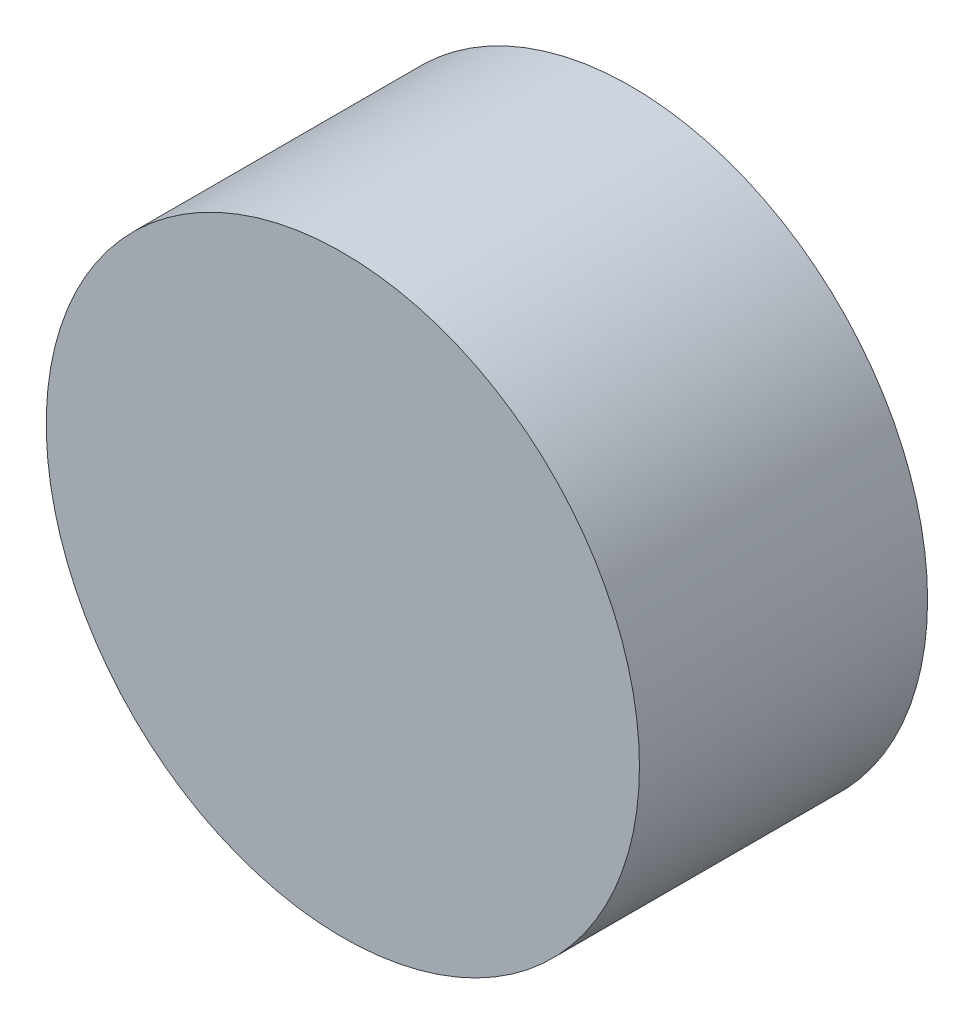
ISO-10303-21;
HEADER;
FILE_DESCRIPTION(('STEP AP214'),'2;1');
FILE_NAME('part.step','',(''),(''),'','','');
FILE_SCHEMA(('AUTOMOTIVE_DESIGN { 1 0 10303 214 1 1 1 1 }'));
ENDSEC;
DATA;
#1=APPLICATION_CONTEXT('core data for automotive mechanical design processes');
#2=APPLICATION_PROTOCOL_DEFINITION('international standard','automotive_design',2000,#1);
#3=PRODUCT_CONTEXT('',#1,'mechanical');
#4=PRODUCT('Part','Part','',(#3));
#5=PRODUCT_RELATED_PRODUCT_CATEGORY('part','',(#4));
#6=PRODUCT_DEFINITION_FORMATION('','',#4);
#7=PRODUCT_DEFINITION_CONTEXT('part definition',#1,'design');
#8=PRODUCT_DEFINITION('design','',#6,#7);
#9=PRODUCT_DEFINITION_SHAPE('','',#8);
#10=(LENGTH_UNIT() NAMED_UNIT(*) SI_UNIT(.MILLI.,.METRE.));
#11=(NAMED_UNIT(*) PLANE_ANGLE_UNIT() SI_UNIT($,.RADIAN.));
#12=(NAMED_UNIT(*) SI_UNIT($,.STERADIAN.) SOLID_ANGLE_UNIT());
#13=UNCERTAINTY_MEASURE_WITH_UNIT(LENGTH_MEASURE(1.E-05),#10,'distance_accuracy_value','');
#14=(GEOMETRIC_REPRESENTATION_CONTEXT(3) GLOBAL_UNCERTAINTY_ASSIGNED_CONTEXT((#13)) GLOBAL_UNIT_ASSIGNED_CONTEXT((#10,
#11,#12)) REPRESENTATION_CONTEXT('',''));
#15=CARTESIAN_POINT('',(0.,0.,0.));
#16=DIRECTION('',(0.,0.,1.));
#17=DIRECTION('',(1.,0.,0.));
#18=AXIS2_PLACEMENT_3D('',#15,#16,#17);
#19=CARTESIAN_POINT('',(0.,0.,10.795));
#20=DIRECTION('',(0.,0.,-1.));
#21=DIRECTION('',(-1.,0.,0.));
#22=AXIS2_PLACEMENT_3D('',#19,#20,#21);
#23=CYLINDRICAL_SURFACE('',#22,22.225);
#24=CARTESIAN_POINT('',(0.,0.,10.795));
#25=DIRECTION('',(0.,0.,1.));
#26=DIRECTION('',(1.,0.,0.));
#27=AXIS2_PLACEMENT_3D('',#24,#25,#26);
#28=CIRCLE('',#27,22.225);
#29=CARTESIAN_POINT('',(22.225,0.,10.795));
#30=VERTEX_POINT('',#29);
#31=EDGE_CURVE('E10',#30,#30,#28,.T.);
#32=ORIENTED_EDGE('',*,*,#31,.F.);
#33=EDGE_LOOP('',(#32));
#34=FACE_BOUND('',#33,.T.);
#35=CARTESIAN_POINT('',(0.,0.,-10.795));
#36=DIRECTION('',(0.,0.,1.));
#37=DIRECTION('',(1.,0.,0.));
#38=AXIS2_PLACEMENT_3D('',#35,#36,#37);
#39=CIRCLE('',#38,22.225);
#40=CARTESIAN_POINT('',(22.225,0.,-10.795));
#41=VERTEX_POINT('',#40);
#42=EDGE_CURVE('E42',#41,#41,#39,.T.);
#43=ORIENTED_EDGE('',*,*,#42,.T.);
#44=EDGE_LOOP('',(#43));
#45=FACE_BOUND('',#44,.T.);
#46=ADVANCED_FACE('F39',(#34,#45),#23,.T.);
#47=CARTESIAN_POINT('',(0.,0.,10.795));
#48=DIRECTION('',(0.,0.,1.));
#49=DIRECTION('',(1.,0.,0.));
#50=AXIS2_PLACEMENT_3D('',#47,#48,#49);
#51=PLANE('',#50);
#52=ORIENTED_EDGE('',*,*,#31,.T.);
#53=EDGE_LOOP('',(#52));
#54=FACE_BOUND('',#53,.T.);
#55=ADVANCED_FACE('F54',(#54),#51,.T.);
#56=CARTESIAN_POINT('',(0.,0.,-10.795));
#57=DIRECTION('',(0.,0.,1.));
#58=DIRECTION('',(1.,0.,0.));
#59=AXIS2_PLACEMENT_3D('',#56,#57,#58);
#60=PLANE('',#59);
#61=ORIENTED_EDGE('',*,*,#42,.F.);
#62=EDGE_LOOP('',(#61));
#63=FACE_BOUND('',#62,.T.);
#64=ADVANCED_FACE('F52',(#63),#60,.F.);
#65=CLOSED_SHELL('',(#46,#55,#64));
#66=MANIFOLD_SOLID_BREP('B2',#65);
#67=ADVANCED_BREP_SHAPE_REPRESENTATION('',(#18,#66),#14);
#68=SHAPE_DEFINITION_REPRESENTATION(#9,#67);
ENDSEC;
END-ISO-10303-21;
